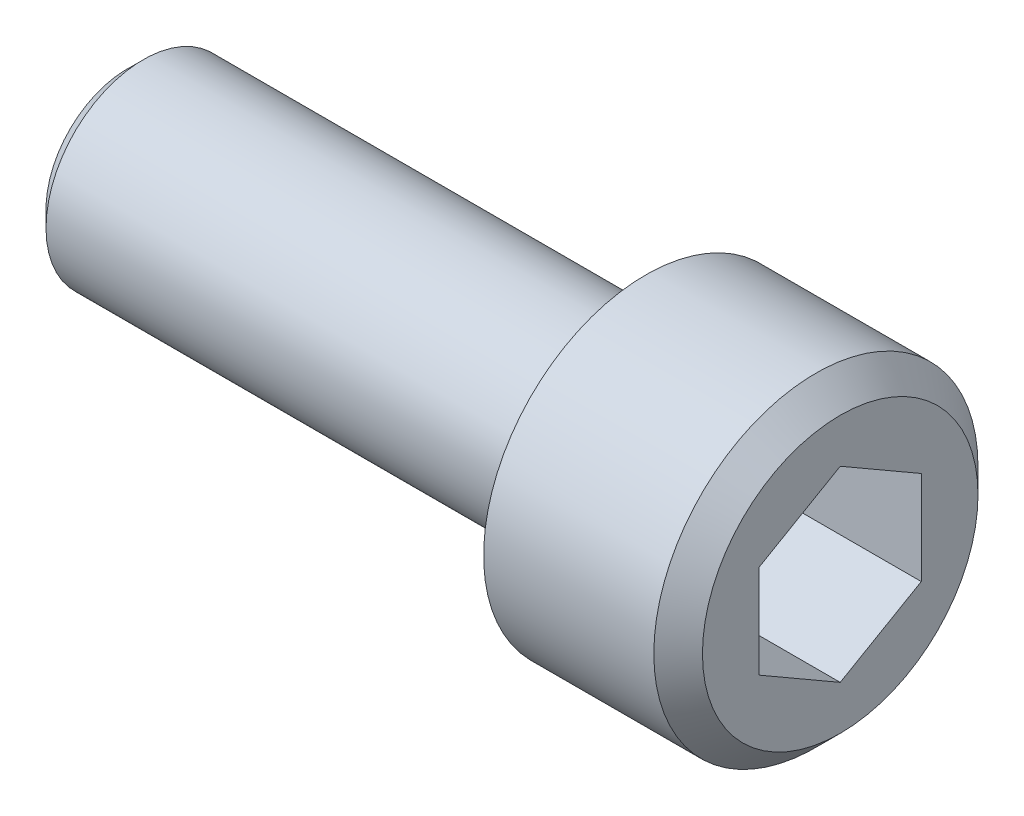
ISO-10303-21;
HEADER;
FILE_DESCRIPTION(('STEP AP214'),'2;1');
FILE_NAME('part.step','',(''),(''),'','','');
FILE_SCHEMA(('AUTOMOTIVE_DESIGN { 1 0 10303 214 1 1 1 1 }'));
ENDSEC;
DATA;
#1=APPLICATION_CONTEXT('core data for automotive mechanical design processes');
#2=APPLICATION_PROTOCOL_DEFINITION('international standard','automotive_design',2000,#1);
#3=PRODUCT_CONTEXT('',#1,'mechanical');
#4=PRODUCT('Part','Part','',(#3));
#5=PRODUCT_RELATED_PRODUCT_CATEGORY('part','',(#4));
#6=PRODUCT_DEFINITION_FORMATION('','',#4);
#7=PRODUCT_DEFINITION_CONTEXT('part definition',#1,'design');
#8=PRODUCT_DEFINITION('design','',#6,#7);
#9=PRODUCT_DEFINITION_SHAPE('','',#8);
#10=(LENGTH_UNIT() NAMED_UNIT(*) SI_UNIT(.MILLI.,.METRE.));
#11=(NAMED_UNIT(*) PLANE_ANGLE_UNIT() SI_UNIT($,.RADIAN.));
#12=(NAMED_UNIT(*) SI_UNIT($,.STERADIAN.) SOLID_ANGLE_UNIT());
#13=UNCERTAINTY_MEASURE_WITH_UNIT(LENGTH_MEASURE(1.E-05),#10,'distance_accuracy_value','');
#14=(GEOMETRIC_REPRESENTATION_CONTEXT(3) GLOBAL_UNCERTAINTY_ASSIGNED_CONTEXT((#13)) GLOBAL_UNIT_ASSIGNED_CONTEXT((#10,
#11,#12)) REPRESENTATION_CONTEXT('',''));
#15=CARTESIAN_POINT('',(0.,0.,0.));
#16=DIRECTION('',(0.,0.,1.));
#17=DIRECTION('',(1.,0.,0.));
#18=AXIS2_PLACEMENT_3D('',#15,#16,#17);
#19=CARTESIAN_POINT('',(18.,0.,0.));
#20=DIRECTION('',(1.,0.,0.));
#21=DIRECTION('',(0.,0.,-1.));
#22=AXIS2_PLACEMENT_3D('',#19,#20,#21);
#23=PLANE('',#22);
#24=DIRECTION('',(0.,-0.5,0.866025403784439));
#25=VECTOR('',#24,1.);
#26=CARTESIAN_POINT('',(18.,2.88675134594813,0.));
#27=LINE('',#26,#25);
#28=CARTESIAN_POINT('',(18.,2.88675134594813,0.));
#29=VERTEX_POINT('',#28);
#30=CARTESIAN_POINT('',(18.,1.44337567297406,2.5));
#31=VERTEX_POINT('',#30);
#32=EDGE_CURVE('E83',#29,#31,#27,.T.);
#33=ORIENTED_EDGE('',*,*,#32,.T.);
#34=DIRECTION('',(0.,1.,0.));
#35=VECTOR('',#34,1.);
#36=CARTESIAN_POINT('',(18.,1.44337567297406,2.5));
#37=LINE('',#36,#35);
#38=CARTESIAN_POINT('',(18.,-1.44337567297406,2.5));
#39=VERTEX_POINT('',#38);
#40=EDGE_CURVE('E67',#31,#39,#37,.F.);
#41=ORIENTED_EDGE('',*,*,#40,.T.);
#42=DIRECTION('',(0.,-0.5,-0.866025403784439));
#43=VECTOR('',#42,1.);
#44=CARTESIAN_POINT('',(18.,-1.44337567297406,2.5));
#45=LINE('',#44,#43);
#46=CARTESIAN_POINT('',(18.,-2.88675134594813,0.));
#47=VERTEX_POINT('',#46);
#48=EDGE_CURVE('E72',#39,#47,#45,.T.);
#49=ORIENTED_EDGE('',*,*,#48,.T.);
#50=DIRECTION('',(0.,0.5,-0.866025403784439));
#51=VECTOR('',#50,1.);
#52=CARTESIAN_POINT('',(18.,-2.88675134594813,0.));
#53=LINE('',#52,#51);
#54=CARTESIAN_POINT('',(18.,-1.44337567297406,-2.5));
#55=VERTEX_POINT('',#54);
#56=EDGE_CURVE('E128',#47,#55,#53,.T.);
#57=ORIENTED_EDGE('',*,*,#56,.T.);
#58=DIRECTION('',(0.,1.,0.));
#59=VECTOR('',#58,1.);
#60=CARTESIAN_POINT('',(18.,-1.44337567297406,-2.5));
#61=LINE('',#60,#59);
#62=CARTESIAN_POINT('',(18.,1.44337567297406,-2.5));
#63=VERTEX_POINT('',#62);
#64=EDGE_CURVE('E132',#55,#63,#61,.T.);
#65=ORIENTED_EDGE('',*,*,#64,.T.);
#66=DIRECTION('',(0.,0.5,0.866025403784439));
#67=VECTOR('',#66,1.);
#68=CARTESIAN_POINT('',(18.,1.44337567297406,-2.5));
#69=LINE('',#68,#67);
#70=EDGE_CURVE('E137',#63,#29,#69,.T.);
#71=ORIENTED_EDGE('',*,*,#70,.T.);
#72=EDGE_LOOP('',(#33,#41,#49,#57,#65,#71));
#73=FACE_BOUND('',#72,.T.);
#74=ADVANCED_FACE('F17',(#73),#23,.T.);
#75=CARTESIAN_POINT('',(22.,-1.44337567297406,2.5));
#76=DIRECTION('',(0.,-0.866025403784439,0.5));
#77=DIRECTION('',(0.,-0.5,-0.866025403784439));
#78=AXIS2_PLACEMENT_3D('',#75,#76,#77);
#79=PLANE('',#78);
#80=DIRECTION('',(1.,0.,0.));
#81=VECTOR('',#80,1.);
#82=CARTESIAN_POINT('',(22.,-1.44337567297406,2.5));
#83=LINE('',#82,#81);
#84=CARTESIAN_POINT('',(22.,-1.44337567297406,2.5));
#85=VERTEX_POINT('',#84);
#86=EDGE_CURVE('E74',#39,#85,#83,.T.);
#87=ORIENTED_EDGE('',*,*,#86,.T.);
#88=DIRECTION('',(0.,0.5,0.866025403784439));
#89=VECTOR('',#88,1.);
#90=CARTESIAN_POINT('',(22.,-2.88675134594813,0.));
#91=LINE('',#90,#89);
#92=CARTESIAN_POINT('',(22.,-2.88675134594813,0.));
#93=VERTEX_POINT('',#92);
#94=EDGE_CURVE('E126',#93,#85,#91,.T.);
#95=ORIENTED_EDGE('',*,*,#94,.F.);
#96=DIRECTION('',(1.,0.,0.));
#97=VECTOR('',#96,1.);
#98=CARTESIAN_POINT('',(22.,-2.88675134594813,0.));
#99=LINE('',#98,#97);
#100=EDGE_CURVE('E77',#93,#47,#99,.F.);
#101=ORIENTED_EDGE('',*,*,#100,.T.);
#102=ORIENTED_EDGE('',*,*,#48,.F.);
#103=EDGE_LOOP('',(#87,#95,#101,#102));
#104=FACE_BOUND('',#103,.T.);
#105=ADVANCED_FACE('F73',(#104),#79,.F.);
#106=CARTESIAN_POINT('',(22.,1.44337567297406,2.5));
#107=DIRECTION('',(0.,0.,1.));
#108=DIRECTION('',(1.,0.,0.));
#109=AXIS2_PLACEMENT_3D('',#106,#107,#108);
#110=PLANE('',#109);
#111=DIRECTION('',(1.,0.,0.));
#112=VECTOR('',#111,1.);
#113=CARTESIAN_POINT('',(22.,1.44337567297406,2.5));
#114=LINE('',#113,#112);
#115=CARTESIAN_POINT('',(22.,1.44337567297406,2.5));
#116=VERTEX_POINT('',#115);
#117=EDGE_CURVE('E85',#31,#116,#114,.T.);
#118=ORIENTED_EDGE('',*,*,#117,.T.);
#119=DIRECTION('',(0.,1.,0.));
#120=VECTOR('',#119,1.);
#121=CARTESIAN_POINT('',(22.,2.125,2.5));
#122=LINE('',#121,#120);
#123=EDGE_CURVE('E89',#85,#116,#122,.T.);
#124=ORIENTED_EDGE('',*,*,#123,.F.);
#125=ORIENTED_EDGE('',*,*,#86,.F.);
#126=ORIENTED_EDGE('',*,*,#40,.F.);
#127=EDGE_LOOP('',(#118,#124,#125,#126));
#128=FACE_BOUND('',#127,.T.);
#129=ADVANCED_FACE('F87',(#128),#110,.F.);
#130=CARTESIAN_POINT('',(22.,2.88675134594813,0.));
#131=DIRECTION('',(0.,0.866025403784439,0.5));
#132=DIRECTION('',(0.,-0.5,0.866025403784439));
#133=AXIS2_PLACEMENT_3D('',#130,#131,#132);
#134=PLANE('',#133);
#135=DIRECTION('',(1.,0.,0.));
#136=VECTOR('',#135,1.);
#137=CARTESIAN_POINT('',(22.,2.88675134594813,0.));
#138=LINE('',#137,#136);
#139=CARTESIAN_POINT('',(22.,2.88675134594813,0.));
#140=VERTEX_POINT('',#139);
#141=EDGE_CURVE('E139',#29,#140,#138,.T.);
#142=ORIENTED_EDGE('',*,*,#141,.T.);
#143=DIRECTION('',(0.,0.5,-0.866025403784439));
#144=VECTOR('',#143,1.);
#145=CARTESIAN_POINT('',(22.,1.44337567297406,2.5));
#146=LINE('',#145,#144);
#147=EDGE_CURVE('E122',#116,#140,#146,.T.);
#148=ORIENTED_EDGE('',*,*,#147,.F.);
#149=ORIENTED_EDGE('',*,*,#117,.F.);
#150=ORIENTED_EDGE('',*,*,#32,.F.);
#151=EDGE_LOOP('',(#142,#148,#149,#150));
#152=FACE_BOUND('',#151,.T.);
#153=ADVANCED_FACE('F143',(#152),#134,.F.);
#154=CARTESIAN_POINT('',(22.,1.44337567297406,-2.5));
#155=DIRECTION('',(0.,0.866025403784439,-0.5));
#156=DIRECTION('',(0.,0.5,0.866025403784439));
#157=AXIS2_PLACEMENT_3D('',#154,#155,#156);
#158=PLANE('',#157);
#159=DIRECTION('',(-1.,0.,0.));
#160=VECTOR('',#159,1.);
#161=CARTESIAN_POINT('',(22.,1.44337567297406,-2.5));
#162=LINE('',#161,#160);
#163=CARTESIAN_POINT('',(22.,1.44337567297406,-2.5));
#164=VERTEX_POINT('',#163);
#165=EDGE_CURVE('E135',#63,#164,#162,.F.);
#166=ORIENTED_EDGE('',*,*,#165,.T.);
#167=DIRECTION('',(0.,-0.5,-0.866025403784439));
#168=VECTOR('',#167,1.);
#169=CARTESIAN_POINT('',(22.,2.88675134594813,0.));
#170=LINE('',#169,#168);
#171=EDGE_CURVE('E119',#140,#164,#170,.T.);
#172=ORIENTED_EDGE('',*,*,#171,.F.);
#173=ORIENTED_EDGE('',*,*,#141,.F.);
#174=ORIENTED_EDGE('',*,*,#70,.F.);
#175=EDGE_LOOP('',(#166,#172,#173,#174));
#176=FACE_BOUND('',#175,.T.);
#177=ADVANCED_FACE('F154',(#176),#158,.F.);
#178=CARTESIAN_POINT('',(22.,-1.44337567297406,-2.5));
#179=DIRECTION('',(0.,0.,-1.));
#180=DIRECTION('',(-1.,0.,0.));
#181=AXIS2_PLACEMENT_3D('',#178,#179,#180);
#182=PLANE('',#181);
#183=DIRECTION('',(1.,0.,0.));
#184=VECTOR('',#183,1.);
#185=CARTESIAN_POINT('',(22.,-1.44337567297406,-2.5));
#186=LINE('',#185,#184);
#187=CARTESIAN_POINT('',(22.,-1.44337567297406,-2.5));
#188=VERTEX_POINT('',#187);
#189=EDGE_CURVE('E35',#55,#188,#186,.T.);
#190=ORIENTED_EDGE('',*,*,#189,.T.);
#191=DIRECTION('',(0.,1.,0.));
#192=VECTOR('',#191,1.);
#193=CARTESIAN_POINT('',(22.,2.125,-2.5));
#194=LINE('',#193,#192);
#195=EDGE_CURVE('E116',#164,#188,#194,.F.);
#196=ORIENTED_EDGE('',*,*,#195,.F.);
#197=ORIENTED_EDGE('',*,*,#165,.F.);
#198=ORIENTED_EDGE('',*,*,#64,.F.);
#199=EDGE_LOOP('',(#190,#196,#197,#198));
#200=FACE_BOUND('',#199,.T.);
#201=ADVANCED_FACE('F152',(#200),#182,.F.);
#202=CARTESIAN_POINT('',(22.,-2.88675134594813,0.));
#203=DIRECTION('',(0.,-0.866025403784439,-0.5));
#204=DIRECTION('',(0.,0.5,-0.866025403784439));
#205=AXIS2_PLACEMENT_3D('',#202,#203,#204);
#206=PLANE('',#205);
#207=ORIENTED_EDGE('',*,*,#100,.F.);
#208=DIRECTION('',(0.,-0.5,0.866025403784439));
#209=VECTOR('',#208,1.);
#210=CARTESIAN_POINT('',(22.,-1.44337567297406,-2.5));
#211=LINE('',#210,#209);
#212=EDGE_CURVE('E108',#188,#93,#211,.T.);
#213=ORIENTED_EDGE('',*,*,#212,.F.);
#214=ORIENTED_EDGE('',*,*,#189,.F.);
#215=ORIENTED_EDGE('',*,*,#56,.F.);
#216=EDGE_LOOP('',(#207,#213,#214,#215));
#217=FACE_BOUND('',#216,.T.);
#218=ADVANCED_FACE('F150',(#217),#206,.F.);
#219=CARTESIAN_POINT('',(22.,2.125,0.));
#220=DIRECTION('',(1.,0.,0.));
#221=DIRECTION('',(0.,0.,-1.));
#222=AXIS2_PLACEMENT_3D('',#219,#220,#221);
#223=PLANE('',#222);
#224=ORIENTED_EDGE('',*,*,#195,.T.);
#225=ORIENTED_EDGE('',*,*,#212,.T.);
#226=ORIENTED_EDGE('',*,*,#94,.T.);
#227=ORIENTED_EDGE('',*,*,#123,.T.);
#228=ORIENTED_EDGE('',*,*,#147,.T.);
#229=ORIENTED_EDGE('',*,*,#171,.T.);
#230=EDGE_LOOP('',(#224,#225,#226,#227,#228,#229));
#231=FACE_BOUND('',#230,.T.);
#232=CARTESIAN_POINT('',(22.0000000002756,0.,0.));
#233=DIRECTION('',(-1.,0.,0.));
#234=DIRECTION('',(0.,0.,1.));
#235=AXIS2_PLACEMENT_3D('',#232,#233,#234);
#236=CIRCLE('',#235,4.2500000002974);
#237=CARTESIAN_POINT('',(22.0000000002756,0.,4.2500000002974));
#238=VERTEX_POINT('',#237);
#239=EDGE_CURVE('E20',#238,#238,#236,.T.);
#240=ORIENTED_EDGE('',*,*,#239,.F.);
#241=EDGE_LOOP('',(#240));
#242=FACE_BOUND('',#241,.T.);
#243=ADVANCED_FACE('F147',(#231,#242),#223,.T.);
#244=CARTESIAN_POINT('',(21.2499999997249,0.,0.));
#245=DIRECTION('',(-1.,0.,0.));
#246=DIRECTION('',(0.,0.,1.));
#247=AXIS2_PLACEMENT_3D('',#244,#245,#246);
#248=CONICAL_SURFACE('',#247,4.99999999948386,0.785398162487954);
#249=CARTESIAN_POINT('',(21.25,0.,0.));
#250=DIRECTION('',(1.,0.,0.));
#251=DIRECTION('',(0.,0.,-1.));
#252=AXIS2_PLACEMENT_3D('',#249,#250,#251);
#253=CIRCLE('',#252,5.);
#254=CARTESIAN_POINT('',(21.25,0.,-5.));
#255=VERTEX_POINT('',#254);
#256=EDGE_CURVE('E100',#255,#255,#253,.F.);
#257=ORIENTED_EDGE('',*,*,#256,.F.);
#258=EDGE_LOOP('',(#257));
#259=FACE_BOUND('',#258,.T.);
#260=ORIENTED_EDGE('',*,*,#239,.T.);
#261=EDGE_LOOP('',(#260));
#262=FACE_BOUND('',#261,.T.);
#263=ADVANCED_FACE('F187',(#259,#262),#248,.T.);
#264=CARTESIAN_POINT('',(18.625,0.,0.));
#265=DIRECTION('',(1.,0.,0.));
#266=DIRECTION('',(0.,0.,-1.));
#267=AXIS2_PLACEMENT_3D('',#264,#265,#266);
#268=CYLINDRICAL_SURFACE('',#267,5.);
#269=CARTESIAN_POINT('',(16.,0.,0.));
#270=DIRECTION('',(1.,0.,0.));
#271=DIRECTION('',(0.,0.,-1.));
#272=AXIS2_PLACEMENT_3D('',#269,#270,#271);
#273=CIRCLE('',#272,5.);
#274=CARTESIAN_POINT('',(16.,0.,-5.));
#275=VERTEX_POINT('',#274);
#276=EDGE_CURVE('E98',#275,#275,#273,.F.);
#277=ORIENTED_EDGE('',*,*,#276,.F.);
#278=EDGE_LOOP('',(#277));
#279=FACE_BOUND('',#278,.T.);
#280=ORIENTED_EDGE('',*,*,#256,.T.);
#281=EDGE_LOOP('',(#280));
#282=FACE_BOUND('',#281,.T.);
#283=ADVANCED_FACE('F183',(#279,#282),#268,.T.);
#284=CARTESIAN_POINT('',(0.,1.25,0.));
#285=DIRECTION('',(-1.,0.,0.));
#286=DIRECTION('',(0.,0.,1.));
#287=AXIS2_PLACEMENT_3D('',#284,#285,#286);
#288=PLANE('',#287);
#289=CARTESIAN_POINT('',(-2.27373675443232E-10,0.,0.));
#290=DIRECTION('',(1.,0.,0.));
#291=DIRECTION('',(0.,0.,-1.));
#292=AXIS2_PLACEMENT_3D('',#289,#290,#291);
#293=CIRCLE('',#292,2.5000000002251);
#294=CARTESIAN_POINT('',(-2.27373675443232E-10,0.,-2.5000000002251));
#295=VERTEX_POINT('',#294);
#296=EDGE_CURVE('E96',#295,#295,#293,.T.);
#297=ORIENTED_EDGE('',*,*,#296,.F.);
#298=EDGE_LOOP('',(#297));
#299=FACE_BOUND('',#298,.T.);
#300=ADVANCED_FACE('F179',(#299),#288,.T.);
#301=CARTESIAN_POINT('',(16.,4.,0.));
#302=DIRECTION('',(-1.,0.,0.));
#303=DIRECTION('',(0.,0.,1.));
#304=AXIS2_PLACEMENT_3D('',#301,#302,#303);
#305=PLANE('',#304);
#306=CARTESIAN_POINT('',(16.,0.,0.));
#307=DIRECTION('',(1.,0.,0.));
#308=DIRECTION('',(0.,0.,-1.));
#309=AXIS2_PLACEMENT_3D('',#306,#307,#308);
#310=CIRCLE('',#309,3.);
#311=CARTESIAN_POINT('',(16.,0.,-3.));
#312=VERTEX_POINT('',#311);
#313=EDGE_CURVE('E26',#312,#312,#310,.F.);
#314=ORIENTED_EDGE('',*,*,#313,.F.);
#315=EDGE_LOOP('',(#314));
#316=FACE_BOUND('',#315,.T.);
#317=ORIENTED_EDGE('',*,*,#276,.T.);
#318=EDGE_LOOP('',(#317));
#319=FACE_BOUND('',#318,.T.);
#320=ADVANCED_FACE('F172',(#316,#319),#305,.T.);
#321=CARTESIAN_POINT('',(0.50000000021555,0.,0.));
#322=DIRECTION('',(1.,0.,0.));
#323=DIRECTION('',(0.,0.,-1.));
#324=AXIS2_PLACEMENT_3D('',#321,#322,#323);
#325=CONICAL_SURFACE('',#324,2.99999999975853,0.785398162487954);
#326=ORIENTED_EDGE('',*,*,#296,.T.);
#327=EDGE_LOOP('',(#326));
#328=FACE_BOUND('',#327,.T.);
#329=CARTESIAN_POINT('',(0.5,0.,0.));
#330=DIRECTION('',(1.,0.,0.));
#331=DIRECTION('',(0.,0.,-1.));
#332=AXIS2_PLACEMENT_3D('',#329,#330,#331);
#333=CIRCLE('',#332,3.);
#334=CARTESIAN_POINT('',(0.5,0.,-3.));
#335=VERTEX_POINT('',#334);
#336=EDGE_CURVE('E11',#335,#335,#333,.T.);
#337=ORIENTED_EDGE('',*,*,#336,.F.);
#338=EDGE_LOOP('',(#337));
#339=FACE_BOUND('',#338,.T.);
#340=ADVANCED_FACE('F166',(#328,#339),#325,.T.);
#341=CARTESIAN_POINT('',(8.25,0.,0.));
#342=DIRECTION('',(1.,0.,0.));
#343=DIRECTION('',(0.,0.,-1.));
#344=AXIS2_PLACEMENT_3D('',#341,#342,#343);
#345=CYLINDRICAL_SURFACE('',#344,3.);
#346=ORIENTED_EDGE('',*,*,#336,.T.);
#347=EDGE_LOOP('',(#346));
#348=FACE_BOUND('',#347,.T.);
#349=ORIENTED_EDGE('',*,*,#313,.T.);
#350=EDGE_LOOP('',(#349));
#351=FACE_BOUND('',#350,.T.);
#352=ADVANCED_FACE('F164',(#348,#351),#345,.T.);
#353=CLOSED_SHELL('',(#74,#105,#129,#153,#177,#201,#218,#243,#263,#283,#300,#320,#340,#352));
#354=MANIFOLD_SOLID_BREP('B1',#353);
#355=ADVANCED_BREP_SHAPE_REPRESENTATION('',(#18,#354),#14);
#356=SHAPE_DEFINITION_REPRESENTATION(#9,#355);
ENDSEC;
END-ISO-10303-21;
